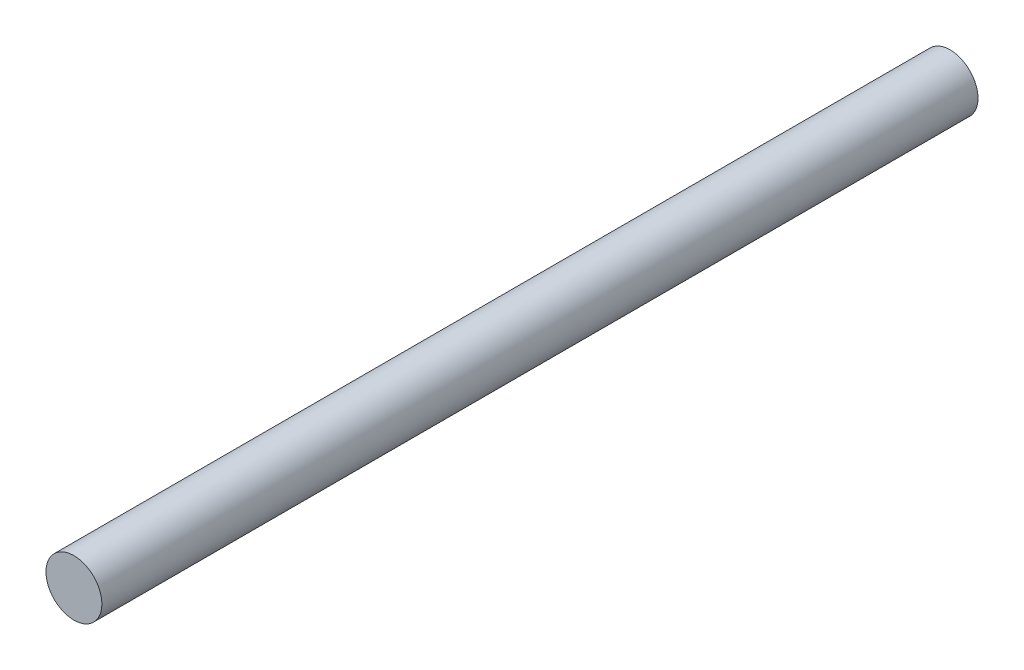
ISO-10303-21;
HEADER;
FILE_DESCRIPTION(('STEP AP214'),'2;1');
FILE_NAME('part.step','',(''),(''),'','','');
FILE_SCHEMA(('AUTOMOTIVE_DESIGN { 1 0 10303 214 1 1 1 1 }'));
ENDSEC;
DATA;
#1=APPLICATION_CONTEXT('core data for automotive mechanical design processes');
#2=APPLICATION_PROTOCOL_DEFINITION('international standard','automotive_design',2000,#1);
#3=PRODUCT_CONTEXT('',#1,'mechanical');
#4=PRODUCT('Part','Part','',(#3));
#5=PRODUCT_RELATED_PRODUCT_CATEGORY('part','',(#4));
#6=PRODUCT_DEFINITION_FORMATION('','',#4);
#7=PRODUCT_DEFINITION_CONTEXT('part definition',#1,'design');
#8=PRODUCT_DEFINITION('design','',#6,#7);
#9=PRODUCT_DEFINITION_SHAPE('','',#8);
#10=(LENGTH_UNIT() NAMED_UNIT(*) SI_UNIT(.MILLI.,.METRE.));
#11=(NAMED_UNIT(*) PLANE_ANGLE_UNIT() SI_UNIT($,.RADIAN.));
#12=(NAMED_UNIT(*) SI_UNIT($,.STERADIAN.) SOLID_ANGLE_UNIT());
#13=UNCERTAINTY_MEASURE_WITH_UNIT(LENGTH_MEASURE(1.E-05),#10,'distance_accuracy_value','');
#14=(GEOMETRIC_REPRESENTATION_CONTEXT(3) GLOBAL_UNCERTAINTY_ASSIGNED_CONTEXT((#13)) GLOBAL_UNIT_ASSIGNED_CONTEXT((#10,
#11,#12)) REPRESENTATION_CONTEXT('',''));
#15=CARTESIAN_POINT('',(0.,0.,0.));
#16=DIRECTION('',(0.,0.,1.));
#17=DIRECTION('',(1.,0.,0.));
#18=AXIS2_PLACEMENT_3D('',#15,#16,#17);
#19=CARTESIAN_POINT('',(0.,0.,94.));
#20=DIRECTION('',(0.,0.,-1.));
#21=DIRECTION('',(-1.,0.,0.));
#22=AXIS2_PLACEMENT_3D('',#19,#20,#21);
#23=CYLINDRICAL_SURFACE('',#22,3.);
#24=CARTESIAN_POINT('',(0.,0.,94.));
#25=DIRECTION('',(0.,0.,1.));
#26=DIRECTION('',(1.,0.,0.));
#27=AXIS2_PLACEMENT_3D('',#24,#25,#26);
#28=CIRCLE('',#27,3.);
#29=CARTESIAN_POINT('',(3.,0.,94.));
#30=VERTEX_POINT('',#29);
#31=EDGE_CURVE('E10',#30,#30,#28,.T.);
#32=ORIENTED_EDGE('',*,*,#31,.F.);
#33=EDGE_LOOP('',(#32));
#34=FACE_BOUND('',#33,.T.);
#35=CARTESIAN_POINT('',(0.,0.,0.));
#36=DIRECTION('',(0.,0.,1.));
#37=DIRECTION('',(1.,0.,0.));
#38=AXIS2_PLACEMENT_3D('',#35,#36,#37);
#39=CIRCLE('',#38,3.);
#40=CARTESIAN_POINT('',(3.,0.,0.));
#41=VERTEX_POINT('',#40);
#42=EDGE_CURVE('E38',#41,#41,#39,.T.);
#43=ORIENTED_EDGE('',*,*,#42,.T.);
#44=EDGE_LOOP('',(#43));
#45=FACE_BOUND('',#44,.T.);
#46=ADVANCED_FACE('F35',(#34,#45),#23,.T.);
#47=CARTESIAN_POINT('',(0.,0.,94.));
#48=DIRECTION('',(0.,0.,1.));
#49=DIRECTION('',(1.,0.,0.));
#50=AXIS2_PLACEMENT_3D('',#47,#48,#49);
#51=PLANE('',#50);
#52=ORIENTED_EDGE('',*,*,#31,.T.);
#53=EDGE_LOOP('',(#52));
#54=FACE_BOUND('',#53,.T.);
#55=ADVANCED_FACE('F50',(#54),#51,.T.);
#56=CARTESIAN_POINT('',(0.,0.,0.));
#57=DIRECTION('',(0.,0.,1.));
#58=DIRECTION('',(1.,0.,0.));
#59=AXIS2_PLACEMENT_3D('',#56,#57,#58);
#60=PLANE('',#59);
#61=ORIENTED_EDGE('',*,*,#42,.F.);
#62=EDGE_LOOP('',(#61));
#63=FACE_BOUND('',#62,.T.);
#64=ADVANCED_FACE('F48',(#63),#60,.F.);
#65=CLOSED_SHELL('',(#46,#55,#64));
#66=MANIFOLD_SOLID_BREP('B2',#65);
#67=ADVANCED_BREP_SHAPE_REPRESENTATION('',(#18,#66),#14);
#68=SHAPE_DEFINITION_REPRESENTATION(#9,#67);
ENDSEC;
END-ISO-10303-21;
